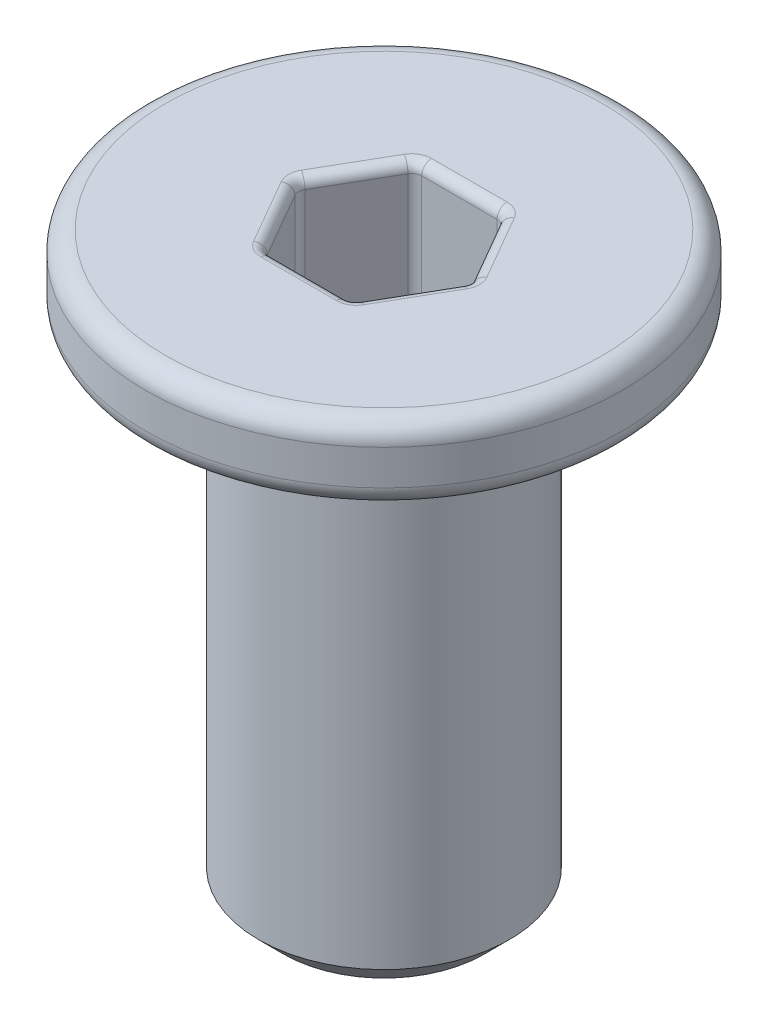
from build123d import *

# Parameters (mm, degrees)
CHC_DEPTH = 5
CONG_1_R  = 0.2


with BuildPart() as part:
    # Esquisse1 → Vis (revolve)
    with BuildSketch(Plane.XY, mode=Mode.PRIVATE) as vis_sk:
        with BuildLine():
            Line((-2.5, 0), (-4.35, 0))
            ThreePointArc((-4.35, 0), (-4.632842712, 0.117157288), (-4.75, 0.4))
            Line((-4.75, 0.4), (-4.75, 1.1))
            ThreePointArc((-4.75, 1.1), (-4.632842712, 1.382842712), (-4.35, 1.5))
            Line((-4.35, 1.5), (0, 1.5))
            Line((0, 1.5), (0, -10))
            Line((0, -10), (-2, -10))
            Line((-2, -10), (-2.5, -9.5))
            Line((-2.5, -9.5), (-2.5, 0))
        make_face()
    revolve(vis_sk.sketch.rotate(Axis((0, 16.5, 0), (0, -1, 0)), 270), axis=Axis((0, 16.5, 0), (0, -1, 0)))

    # Esquisse2 → CHC (cut)
    with BuildSketch(Plane(origin=(0, 1.5, 0), x_dir=(-1, 0, 0), z_dir=(0, 1, 0))):
        Polygon((0.866025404, -1.5), (-0.866025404, -1.5), (-1.732050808, 0), (-0.866025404, 1.5), (0.866025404, 1.5), (1.732050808, 0), align=None)
    extrude(amount=-CHC_DEPTH, mode=Mode.SUBTRACT)

    # Cong_1
    cong_1_edges = [part.edges().sort_by_distance(p)[0] for p in [
        (0, 1.5, -1.5),
        (1.299038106, 1.5, -0.75),
        (1.299038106, 1.5, 0.75),
        (0, 1.5, 1.5),
        (-1.299038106, 1.5, 0.75),
        (-1.299038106, 1.5, -0.75),
        (-0.866025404, -1, -1.5),
        (0.866025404, -1, -1.5),
        (0, -3.5, -1.5),
        (1.732050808, -1, 0),
        (1.299038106, -3.5, -0.75),
        (0.866025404, -1, 1.5),
        (1.299038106, -3.5, 0.75),
        (-0.866025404, -1, 1.5),
        (0, -3.5, 1.5),
        (-1.732050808, -1, 0),
        (-1.299038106, -3.5, 0.75),
        (-1.299038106, -3.5, -0.75),
    ]]
    fillet(cong_1_edges, radius=CONG_1_R)


solid = part.part
